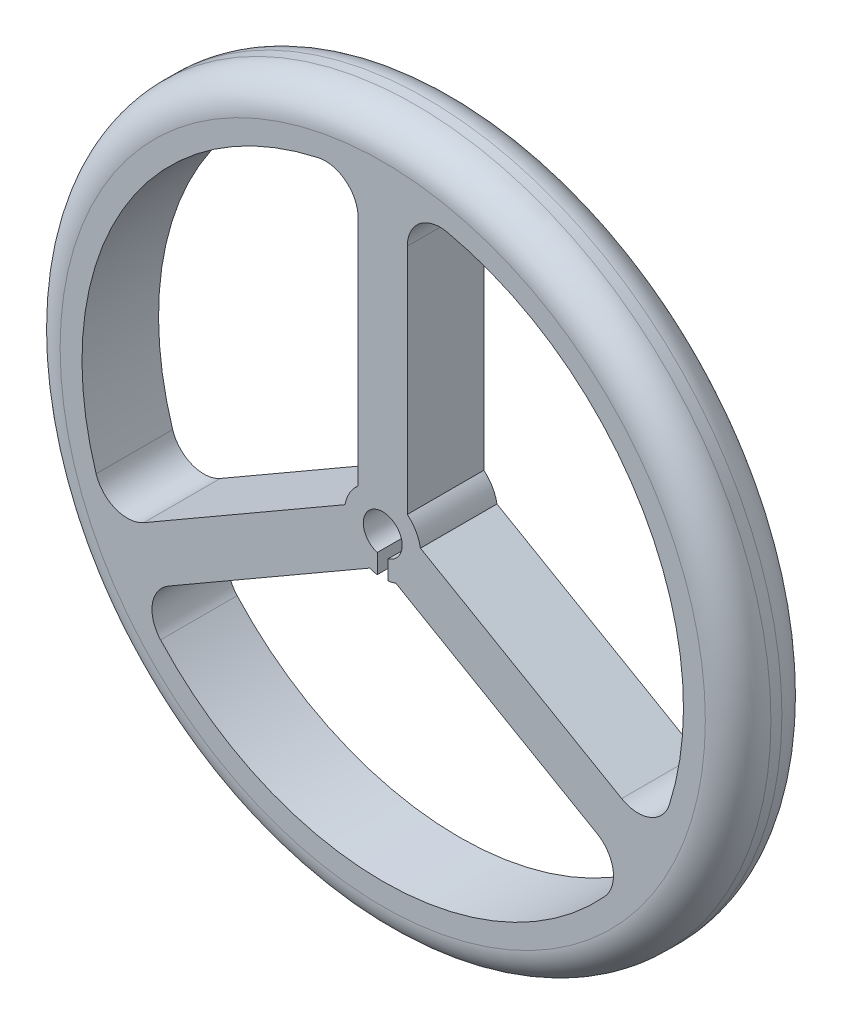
ISO-10303-21;
HEADER;
FILE_DESCRIPTION(('STEP AP214'),'2;1');
FILE_NAME('part.step','',(''),(''),'','','');
FILE_SCHEMA(('AUTOMOTIVE_DESIGN { 1 0 10303 214 1 1 1 1 }'));
ENDSEC;
DATA;
#1=APPLICATION_CONTEXT('core data for automotive mechanical design processes');
#2=APPLICATION_PROTOCOL_DEFINITION('international standard','automotive_design',2000,#1);
#3=PRODUCT_CONTEXT('',#1,'mechanical');
#4=PRODUCT('Part','Part','',(#3));
#5=PRODUCT_RELATED_PRODUCT_CATEGORY('part','',(#4));
#6=PRODUCT_DEFINITION_FORMATION('','',#4);
#7=PRODUCT_DEFINITION_CONTEXT('part definition',#1,'design');
#8=PRODUCT_DEFINITION('design','',#6,#7);
#9=PRODUCT_DEFINITION_SHAPE('','',#8);
#10=(LENGTH_UNIT() NAMED_UNIT(*) SI_UNIT(.MILLI.,.METRE.));
#11=(NAMED_UNIT(*) PLANE_ANGLE_UNIT() SI_UNIT($,.RADIAN.));
#12=(NAMED_UNIT(*) SI_UNIT($,.STERADIAN.) SOLID_ANGLE_UNIT());
#13=UNCERTAINTY_MEASURE_WITH_UNIT(LENGTH_MEASURE(1.E-05),#10,'distance_accuracy_value','');
#14=(GEOMETRIC_REPRESENTATION_CONTEXT(3) GLOBAL_UNCERTAINTY_ASSIGNED_CONTEXT((#13)) GLOBAL_UNIT_ASSIGNED_CONTEXT((#10,
#11,#12)) REPRESENTATION_CONTEXT('',''));
#15=CARTESIAN_POINT('',(0.,0.,0.));
#16=DIRECTION('',(0.,0.,1.));
#17=DIRECTION('',(1.,0.,0.));
#18=AXIS2_PLACEMENT_3D('',#15,#16,#17);
#19=CARTESIAN_POINT('',(0.,0.,7.));
#20=DIRECTION('',(0.,0.,-1.));
#21=DIRECTION('',(-1.,0.,0.));
#22=AXIS2_PLACEMENT_3D('',#19,#20,#21);
#23=CYLINDRICAL_SURFACE('',#22,3.5);
#24=CARTESIAN_POINT('',(0.,0.,0.));
#25=DIRECTION('',(0.,0.,-1.));
#26=DIRECTION('',(-1.,0.,0.));
#27=AXIS2_PLACEMENT_3D('',#24,#25,#26);
#28=CIRCLE('',#27,3.5);
#29=CARTESIAN_POINT('',(-0.5,-3.46410161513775,0.));
#30=VERTEX_POINT('',#29);
#31=CARTESIAN_POINT('',(-1.19677195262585,-3.28903282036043,0.));
#32=VERTEX_POINT('',#31);
#33=EDGE_CURVE('E274',#30,#32,#28,.T.);
#34=ORIENTED_EDGE('',*,*,#33,.F.);
#35=DIRECTION('',(0.,0.,-1.));
#36=VECTOR('',#35,1.);
#37=CARTESIAN_POINT('',(-0.5,-3.46410161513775,7.));
#38=LINE('',#37,#36);
#39=CARTESIAN_POINT('',(-0.5,-3.46410161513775,7.));
#40=VERTEX_POINT('',#39);
#41=EDGE_CURVE('E376',#30,#40,#38,.F.);
#42=ORIENTED_EDGE('',*,*,#41,.T.);
#43=CARTESIAN_POINT('',(0.,0.,7.));
#44=DIRECTION('',(0.,0.,-1.));
#45=DIRECTION('',(-1.,0.,0.));
#46=AXIS2_PLACEMENT_3D('',#43,#44,#45);
#47=CIRCLE('',#46,3.5);
#48=CARTESIAN_POINT('',(-1.19677195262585,-3.28903282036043,7.));
#49=VERTEX_POINT('',#48);
#50=EDGE_CURVE('E492',#40,#49,#47,.T.);
#51=ORIENTED_EDGE('',*,*,#50,.T.);
#52=DIRECTION('',(0.,0.,-1.));
#53=VECTOR('',#52,1.);
#54=CARTESIAN_POINT('',(-1.19677195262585,-3.28903282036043,7.));
#55=LINE('',#54,#53);
#56=EDGE_CURVE('E504',#49,#32,#55,.T.);
#57=ORIENTED_EDGE('',*,*,#56,.T.);
#58=EDGE_LOOP('',(#34,#42,#51,#57));
#59=FACE_BOUND('',#58,.T.);
#60=ADVANCED_FACE('F115',(#59),#23,.T.);
#61=CARTESIAN_POINT('',(0.,0.,7.));
#62=DIRECTION('',(0.,0.,-1.));
#63=DIRECTION('',(-1.,0.,0.));
#64=AXIS2_PLACEMENT_3D('',#61,#62,#63);
#65=CYLINDRICAL_SURFACE('',#64,27.5);
#66=CARTESIAN_POINT('',(0.,0.,7.));
#67=DIRECTION('',(0.,0.,1.));
#68=DIRECTION('',(1.,0.,0.));
#69=AXIS2_PLACEMENT_3D('',#66,#67,#68);
#70=CIRCLE('',#69,27.5);
#71=CARTESIAN_POINT('',(26.2089128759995,-8.32723758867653,7.));
#72=VERTEX_POINT('',#71);
#73=CARTESIAN_POINT('',(5.89285714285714,26.8612031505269,7.));
#74=VERTEX_POINT('',#73);
#75=EDGE_CURVE('E350',#72,#74,#70,.T.);
#76=ORIENTED_EDGE('',*,*,#75,.T.);
#77=DIRECTION('',(0.,0.,-1.));
#78=VECTOR('',#77,1.);
#79=CARTESIAN_POINT('',(5.89285714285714,26.8612031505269,7.));
#80=LINE('',#79,#78);
#81=CARTESIAN_POINT('',(5.89285714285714,26.8612031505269,0.));
#82=VERTEX_POINT('',#81);
#83=EDGE_CURVE('E390',#74,#82,#80,.T.);
#84=ORIENTED_EDGE('',*,*,#83,.T.);
#85=CARTESIAN_POINT('',(0.,0.,0.));
#86=DIRECTION('',(0.,0.,1.));
#87=DIRECTION('',(1.,0.,0.));
#88=AXIS2_PLACEMENT_3D('',#85,#86,#87);
#89=CIRCLE('',#88,27.5);
#90=CARTESIAN_POINT('',(26.2089128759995,-8.32723758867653,0.));
#91=VERTEX_POINT('',#90);
#92=EDGE_CURVE('E310',#91,#82,#89,.T.);
#93=ORIENTED_EDGE('',*,*,#92,.F.);
#94=DIRECTION('',(0.,0.,-1.));
#95=VECTOR('',#94,1.);
#96=CARTESIAN_POINT('',(26.2089128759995,-8.32723758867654,7.));
#97=LINE('',#96,#95);
#98=EDGE_CURVE('E387',#91,#72,#97,.F.);
#99=ORIENTED_EDGE('',*,*,#98,.T.);
#100=EDGE_LOOP('',(#76,#84,#93,#99));
#101=FACE_BOUND('',#100,.T.);
#102=ADVANCED_FACE('F550',(#101),#65,.F.);
#103=CARTESIAN_POINT('',(-5.89285714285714,26.8612031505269,0.));
#104=VERTEX_POINT('',#103);
#105=CARTESIAN_POINT('',(-26.2089128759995,-8.32723758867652,0.));
#106=VERTEX_POINT('',#105);
#107=EDGE_CURVE('E355',#104,#106,#89,.T.);
#108=ORIENTED_EDGE('',*,*,#107,.F.);
#109=DIRECTION('',(0.,0.,-1.));
#110=VECTOR('',#109,1.);
#111=CARTESIAN_POINT('',(-5.89285714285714,26.8612031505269,7.));
#112=LINE('',#111,#110);
#113=CARTESIAN_POINT('',(-5.89285714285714,26.8612031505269,7.));
#114=VERTEX_POINT('',#113);
#115=EDGE_CURVE('E397',#104,#114,#112,.F.);
#116=ORIENTED_EDGE('',*,*,#115,.T.);
#117=CARTESIAN_POINT('',(-26.2089128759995,-8.32723758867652,7.));
#118=VERTEX_POINT('',#117);
#119=EDGE_CURVE('E349',#114,#118,#70,.T.);
#120=ORIENTED_EDGE('',*,*,#119,.T.);
#121=DIRECTION('',(0.,0.,-1.));
#122=VECTOR('',#121,1.);
#123=CARTESIAN_POINT('',(-26.2089128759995,-8.32723758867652,7.));
#124=LINE('',#123,#122);
#125=EDGE_CURVE('E393',#118,#106,#124,.T.);
#126=ORIENTED_EDGE('',*,*,#125,.T.);
#127=EDGE_LOOP('',(#108,#116,#120,#126));
#128=FACE_BOUND('',#127,.T.);
#129=ADVANCED_FACE('F534',(#128),#65,.F.);
#130=CARTESIAN_POINT('',(-20.3160557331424,-18.5339655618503,7.));
#131=VERTEX_POINT('',#130);
#132=CARTESIAN_POINT('',(20.3160557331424,-18.5339655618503,7.));
#133=VERTEX_POINT('',#132);
#134=EDGE_CURVE('E345',#131,#133,#70,.T.);
#135=ORIENTED_EDGE('',*,*,#134,.T.);
#136=DIRECTION('',(0.,0.,-1.));
#137=VECTOR('',#136,1.);
#138=CARTESIAN_POINT('',(20.3160557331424,-18.5339655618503,7.));
#139=LINE('',#138,#137);
#140=CARTESIAN_POINT('',(20.3160557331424,-18.5339655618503,0.));
#141=VERTEX_POINT('',#140);
#142=EDGE_CURVE('E411',#133,#141,#139,.T.);
#143=ORIENTED_EDGE('',*,*,#142,.T.);
#144=CARTESIAN_POINT('',(-20.3160557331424,-18.5339655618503,0.));
#145=VERTEX_POINT('',#144);
#146=EDGE_CURVE('E351',#145,#141,#89,.T.);
#147=ORIENTED_EDGE('',*,*,#146,.F.);
#148=DIRECTION('',(0.,0.,-1.));
#149=VECTOR('',#148,1.);
#150=CARTESIAN_POINT('',(-20.3160557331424,-18.5339655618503,7.));
#151=LINE('',#150,#149);
#152=EDGE_CURVE('E408',#145,#131,#151,.F.);
#153=ORIENTED_EDGE('',*,*,#152,.T.);
#154=EDGE_LOOP('',(#135,#143,#147,#153));
#155=FACE_BOUND('',#154,.T.);
#156=ADVANCED_FACE('F558',(#155),#65,.F.);
#157=CARTESIAN_POINT('',(0.,0.,7.));
#158=DIRECTION('',(0.,0.,1.));
#159=DIRECTION('',(1.,0.,0.));
#160=AXIS2_PLACEMENT_3D('',#157,#158,#159);
#161=PLANE('',#160);
#162=DIRECTION('',(0.,-1.,0.));
#163=VECTOR('',#162,1.);
#164=CARTESIAN_POINT('',(0.5,-1.52241333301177,7.));
#165=LINE('',#164,#163);
#166=CARTESIAN_POINT('',(0.5,-1.70312213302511,7.));
#167=VERTEX_POINT('',#166);
#168=CARTESIAN_POINT('',(0.5,-3.46410161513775,7.));
#169=VERTEX_POINT('',#168);
#170=EDGE_CURVE('E268',#167,#169,#165,.T.);
#171=ORIENTED_EDGE('',*,*,#170,.T.);
#172=CARTESIAN_POINT('',(1.19677195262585,-3.28903282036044,7.));
#173=VERTEX_POINT('',#172);
#174=EDGE_CURVE('E486',#173,#169,#47,.T.);
#175=ORIENTED_EDGE('',*,*,#174,.F.);
#176=DIRECTION('',(0.86602540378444,-0.499999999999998,0.));
#177=VECTOR('',#176,1.);
#178=CARTESIAN_POINT('',(-1.125,-1.94855715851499,7.));
#179=LINE('',#178,#177);
#180=CARTESIAN_POINT('',(19.5997587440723,-13.9140021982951,7.));
#181=VERTEX_POINT('',#180);
#182=EDGE_CURVE('E314',#173,#181,#179,.T.);
#183=ORIENTED_EDGE('',*,*,#182,.T.);
#184=CARTESIAN_POINT('',(18.0997587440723,-16.5120784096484,7.));
#185=DIRECTION('',(0.,0.,1.));
#186=DIRECTION('',(1.,0.,0.));
#187=AXIS2_PLACEMENT_3D('',#184,#185,#186);
#188=CIRCLE('',#187,3.);
#189=EDGE_CURVE('E445',#181,#133,#188,.F.);
#190=ORIENTED_EDGE('',*,*,#189,.T.);
#191=ORIENTED_EDGE('',*,*,#134,.F.);
#192=CARTESIAN_POINT('',(-18.0997587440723,-16.5120784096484,7.));
#193=DIRECTION('',(0.,0.,1.));
#194=DIRECTION('',(1.,0.,0.));
#195=AXIS2_PLACEMENT_3D('',#192,#193,#194);
#196=CIRCLE('',#195,3.);
#197=CARTESIAN_POINT('',(-19.5997587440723,-13.9140021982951,7.));
#198=VERTEX_POINT('',#197);
#199=EDGE_CURVE('E451',#131,#198,#196,.F.);
#200=ORIENTED_EDGE('',*,*,#199,.T.);
#201=DIRECTION('',(-0.86602540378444,-0.499999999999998,0.));
#202=VECTOR('',#201,1.);
#203=CARTESIAN_POINT('',(1.12499999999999,-1.94855715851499,7.));
#204=LINE('',#203,#202);
#205=EDGE_CURVE('E333',#49,#198,#204,.T.);
#206=ORIENTED_EDGE('',*,*,#205,.F.);
#207=ORIENTED_EDGE('',*,*,#50,.F.);
#208=DIRECTION('',(0.,-1.,0.));
#209=VECTOR('',#208,1.);
#210=CARTESIAN_POINT('',(-0.5,-1.52241333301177,7.));
#211=LINE('',#210,#209);
#212=CARTESIAN_POINT('',(-0.5,-1.70312213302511,7.));
#213=VERTEX_POINT('',#212);
#214=EDGE_CURVE('E580',#213,#40,#211,.T.);
#215=ORIENTED_EDGE('',*,*,#214,.F.);
#216=CARTESIAN_POINT('',(0.,0.,7.));
#217=DIRECTION('',(0.,0.,-1.));
#218=DIRECTION('',(-1.,0.,0.));
#219=AXIS2_PLACEMENT_3D('',#216,#217,#218);
#220=CIRCLE('',#219,1.775);
#221=EDGE_CURVE('E292',#213,#167,#220,.T.);
#222=ORIENTED_EDGE('',*,*,#221,.T.);
#223=EDGE_LOOP('',(#171,#175,#183,#190,#191,#200,#206,#207,#215,#222));
#224=FACE_BOUND('',#223,.T.);
#225=ORIENTED_EDGE('',*,*,#119,.F.);
#226=CARTESIAN_POINT('',(-5.25,23.9308900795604,7.));
#227=DIRECTION('',(0.,0.,1.));
#228=DIRECTION('',(1.,0.,0.));
#229=AXIS2_PLACEMENT_3D('',#226,#227,#228);
#230=CIRCLE('',#229,3.);
#231=CARTESIAN_POINT('',(-2.25,23.9308900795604,7.));
#232=VERTEX_POINT('',#231);
#233=EDGE_CURVE('E430',#114,#232,#230,.F.);
#234=ORIENTED_EDGE('',*,*,#233,.T.);
#235=DIRECTION('',(0.,1.,0.));
#236=VECTOR('',#235,1.);
#237=CARTESIAN_POINT('',(-2.25,27.5,7.));
#238=LINE('',#237,#236);
#239=CARTESIAN_POINT('',(-2.25,2.6809513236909,7.));
#240=VERTEX_POINT('',#239);
#241=EDGE_CURVE('E306',#232,#240,#238,.F.);
#242=ORIENTED_EDGE('',*,*,#241,.T.);
#243=CARTESIAN_POINT('',(-3.44677195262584,0.608081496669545,7.));
#244=VERTEX_POINT('',#243);
#245=EDGE_CURVE('E485',#244,#240,#47,.T.);
#246=ORIENTED_EDGE('',*,*,#245,.F.);
#247=DIRECTION('',(-0.86602540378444,-0.499999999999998,0.));
#248=VECTOR('',#247,1.);
#249=CARTESIAN_POINT('',(-1.12499999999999,1.94855715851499,7.));
#250=LINE('',#249,#248);
#251=CARTESIAN_POINT('',(-21.8497587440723,-10.0168878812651,7.));
#252=VERTEX_POINT('',#251);
#253=EDGE_CURVE('E329',#244,#252,#250,.T.);
#254=ORIENTED_EDGE('',*,*,#253,.T.);
#255=CARTESIAN_POINT('',(-23.3497587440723,-7.41881166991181,7.));
#256=DIRECTION('',(0.,0.,1.));
#257=DIRECTION('',(1.,0.,0.));
#258=AXIS2_PLACEMENT_3D('',#255,#256,#257);
#259=CIRCLE('',#258,3.);
#260=EDGE_CURVE('E12',#252,#118,#259,.F.);
#261=ORIENTED_EDGE('',*,*,#260,.T.);
#262=EDGE_LOOP('',(#225,#234,#242,#246,#254,#261));
#263=FACE_BOUND('',#262,.T.);
#264=CARTESIAN_POINT('',(2.25,2.6809513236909,7.));
#265=VERTEX_POINT('',#264);
#266=CARTESIAN_POINT('',(3.44677195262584,0.608081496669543,7.));
#267=VERTEX_POINT('',#266);
#268=EDGE_CURVE('E481',#265,#267,#47,.T.);
#269=ORIENTED_EDGE('',*,*,#268,.F.);
#270=DIRECTION('',(0.,1.,0.));
#271=VECTOR('',#270,1.);
#272=CARTESIAN_POINT('',(2.25,27.5,7.));
#273=LINE('',#272,#271);
#274=CARTESIAN_POINT('',(2.25,23.9308900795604,7.));
#275=VERTEX_POINT('',#274);
#276=EDGE_CURVE('E303',#275,#265,#273,.F.);
#277=ORIENTED_EDGE('',*,*,#276,.F.);
#278=CARTESIAN_POINT('',(5.25,23.9308900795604,7.));
#279=DIRECTION('',(0.,0.,1.));
#280=DIRECTION('',(1.,0.,0.));
#281=AXIS2_PLACEMENT_3D('',#278,#279,#280);
#282=CIRCLE('',#281,3.);
#283=EDGE_CURVE('E424',#275,#74,#282,.F.);
#284=ORIENTED_EDGE('',*,*,#283,.T.);
#285=ORIENTED_EDGE('',*,*,#75,.F.);
#286=CARTESIAN_POINT('',(23.3497587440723,-7.41881166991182,7.));
#287=DIRECTION('',(0.,0.,1.));
#288=DIRECTION('',(1.,0.,0.));
#289=AXIS2_PLACEMENT_3D('',#286,#287,#288);
#290=CIRCLE('',#289,3.);
#291=CARTESIAN_POINT('',(21.8497587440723,-10.0168878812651,7.));
#292=VERTEX_POINT('',#291);
#293=EDGE_CURVE('E439',#72,#292,#290,.F.);
#294=ORIENTED_EDGE('',*,*,#293,.T.);
#295=DIRECTION('',(0.86602540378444,-0.499999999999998,0.));
#296=VECTOR('',#295,1.);
#297=CARTESIAN_POINT('',(1.125,1.94855715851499,7.));
#298=LINE('',#297,#296);
#299=EDGE_CURVE('E317',#267,#292,#298,.T.);
#300=ORIENTED_EDGE('',*,*,#299,.F.);
#301=EDGE_LOOP('',(#269,#277,#284,#285,#294,#300));
#302=FACE_BOUND('',#301,.T.);
#303=CARTESIAN_POINT('',(0.,0.,7.));
#304=DIRECTION('',(0.,0.,1.));
#305=DIRECTION('',(1.,0.,0.));
#306=AXIS2_PLACEMENT_3D('',#303,#304,#305);
#307=CIRCLE('',#306,29.5);
#308=CARTESIAN_POINT('',(29.5,0.,7.));
#309=VERTEX_POINT('',#308);
#310=EDGE_CURVE('E356',#309,#309,#307,.T.);
#311=ORIENTED_EDGE('',*,*,#310,.T.);
#312=EDGE_LOOP('',(#311));
#313=FACE_BOUND('',#312,.T.);
#314=ADVANCED_FACE('F477',(#224,#263,#302,#313),#161,.T.);
#315=CARTESIAN_POINT('',(0.,0.,0.));
#316=DIRECTION('',(0.,0.,1.));
#317=DIRECTION('',(1.,0.,0.));
#318=AXIS2_PLACEMENT_3D('',#315,#316,#317);
#319=PLANE('',#318);
#320=CARTESIAN_POINT('',(-3.44677195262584,0.608081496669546,0.));
#321=VERTEX_POINT('',#320);
#322=CARTESIAN_POINT('',(-2.25,2.6809513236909,0.));
#323=VERTEX_POINT('',#322);
#324=EDGE_CURVE('E496',#321,#323,#28,.T.);
#325=ORIENTED_EDGE('',*,*,#324,.T.);
#326=DIRECTION('',(0.,1.,0.));
#327=VECTOR('',#326,1.);
#328=CARTESIAN_POINT('',(-2.25,27.5,0.));
#329=LINE('',#328,#327);
#330=CARTESIAN_POINT('',(-2.25,23.9308900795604,0.));
#331=VERTEX_POINT('',#330);
#332=EDGE_CURVE('E307',#331,#323,#329,.F.);
#333=ORIENTED_EDGE('',*,*,#332,.F.);
#334=CARTESIAN_POINT('',(-5.25,23.9308900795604,0.));
#335=DIRECTION('',(0.,0.,1.));
#336=DIRECTION('',(1.,0.,0.));
#337=AXIS2_PLACEMENT_3D('',#334,#335,#336);
#338=CIRCLE('',#337,3.);
#339=EDGE_CURVE('E433',#331,#104,#338,.T.);
#340=ORIENTED_EDGE('',*,*,#339,.T.);
#341=ORIENTED_EDGE('',*,*,#107,.T.);
#342=CARTESIAN_POINT('',(-23.3497587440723,-7.41881166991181,0.));
#343=DIRECTION('',(0.,0.,1.));
#344=DIRECTION('',(1.,0.,0.));
#345=AXIS2_PLACEMENT_3D('',#342,#343,#344);
#346=CIRCLE('',#345,3.);
#347=CARTESIAN_POINT('',(-21.8497587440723,-10.0168878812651,0.));
#348=VERTEX_POINT('',#347);
#349=EDGE_CURVE('E124',#106,#348,#346,.T.);
#350=ORIENTED_EDGE('',*,*,#349,.T.);
#351=DIRECTION('',(-0.86602540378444,-0.499999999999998,0.));
#352=VECTOR('',#351,1.);
#353=CARTESIAN_POINT('',(-1.12499999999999,1.94855715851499,0.));
#354=LINE('',#353,#352);
#355=EDGE_CURVE('E337',#321,#348,#354,.T.);
#356=ORIENTED_EDGE('',*,*,#355,.F.);
#357=EDGE_LOOP('',(#325,#333,#340,#341,#350,#356));
#358=FACE_BOUND('',#357,.T.);
#359=CARTESIAN_POINT('',(1.19677195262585,-3.28903282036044,0.));
#360=VERTEX_POINT('',#359);
#361=CARTESIAN_POINT('',(0.5,-3.46410161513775,0.));
#362=VERTEX_POINT('',#361);
#363=EDGE_CURVE('E285',#360,#362,#28,.T.);
#364=ORIENTED_EDGE('',*,*,#363,.T.);
#365=DIRECTION('',(0.,-1.,0.));
#366=VECTOR('',#365,1.);
#367=CARTESIAN_POINT('',(0.5,-1.52241333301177,0.));
#368=LINE('',#367,#366);
#369=CARTESIAN_POINT('',(0.5,-1.70312213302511,0.));
#370=VERTEX_POINT('',#369);
#371=EDGE_CURVE('E265',#370,#362,#368,.T.);
#372=ORIENTED_EDGE('',*,*,#371,.F.);
#373=CARTESIAN_POINT('',(0.,0.,0.));
#374=DIRECTION('',(0.,0.,-1.));
#375=DIRECTION('',(-1.,0.,0.));
#376=AXIS2_PLACEMENT_3D('',#373,#374,#375);
#377=CIRCLE('',#376,1.775);
#378=CARTESIAN_POINT('',(-0.5,-1.70312213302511,0.));
#379=VERTEX_POINT('',#378);
#380=EDGE_CURVE('E283',#379,#370,#377,.T.);
#381=ORIENTED_EDGE('',*,*,#380,.F.);
#382=DIRECTION('',(0.,-1.,0.));
#383=VECTOR('',#382,1.);
#384=CARTESIAN_POINT('',(-0.5,-1.52241333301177,0.));
#385=LINE('',#384,#383);
#386=EDGE_CURVE('E287',#379,#30,#385,.T.);
#387=ORIENTED_EDGE('',*,*,#386,.T.);
#388=ORIENTED_EDGE('',*,*,#33,.T.);
#389=DIRECTION('',(-0.86602540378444,-0.499999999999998,0.));
#390=VECTOR('',#389,1.);
#391=CARTESIAN_POINT('',(1.12499999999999,-1.94855715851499,0.));
#392=LINE('',#391,#390);
#393=CARTESIAN_POINT('',(-19.5997587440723,-13.9140021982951,0.));
#394=VERTEX_POINT('',#393);
#395=EDGE_CURVE('E297',#32,#394,#392,.T.);
#396=ORIENTED_EDGE('',*,*,#395,.T.);
#397=CARTESIAN_POINT('',(-18.0997587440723,-16.5120784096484,0.));
#398=DIRECTION('',(0.,0.,1.));
#399=DIRECTION('',(1.,0.,0.));
#400=AXIS2_PLACEMENT_3D('',#397,#398,#399);
#401=CIRCLE('',#400,3.);
#402=EDGE_CURVE('E448',#394,#145,#401,.T.);
#403=ORIENTED_EDGE('',*,*,#402,.T.);
#404=ORIENTED_EDGE('',*,*,#146,.T.);
#405=CARTESIAN_POINT('',(18.0997587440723,-16.5120784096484,0.));
#406=DIRECTION('',(0.,0.,1.));
#407=DIRECTION('',(1.,0.,0.));
#408=AXIS2_PLACEMENT_3D('',#405,#406,#407);
#409=CIRCLE('',#408,3.);
#410=CARTESIAN_POINT('',(19.5997587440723,-13.9140021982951,0.));
#411=VERTEX_POINT('',#410);
#412=EDGE_CURVE('E442',#141,#411,#409,.T.);
#413=ORIENTED_EDGE('',*,*,#412,.T.);
#414=DIRECTION('',(0.86602540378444,-0.499999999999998,0.));
#415=VECTOR('',#414,1.);
#416=CARTESIAN_POINT('',(-1.125,-1.94855715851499,0.));
#417=LINE('',#416,#415);
#418=EDGE_CURVE('E321',#360,#411,#417,.T.);
#419=ORIENTED_EDGE('',*,*,#418,.F.);
#420=EDGE_LOOP('',(#364,#372,#381,#387,#388,#396,#403,#404,#413,#419));
#421=FACE_BOUND('',#420,.T.);
#422=ORIENTED_EDGE('',*,*,#92,.T.);
#423=CARTESIAN_POINT('',(5.25,23.9308900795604,0.));
#424=DIRECTION('',(0.,0.,1.));
#425=DIRECTION('',(1.,0.,0.));
#426=AXIS2_PLACEMENT_3D('',#423,#424,#425);
#427=CIRCLE('',#426,3.);
#428=CARTESIAN_POINT('',(2.25,23.9308900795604,0.));
#429=VERTEX_POINT('',#428);
#430=EDGE_CURVE('E427',#82,#429,#427,.T.);
#431=ORIENTED_EDGE('',*,*,#430,.T.);
#432=DIRECTION('',(0.,1.,0.));
#433=VECTOR('',#432,1.);
#434=CARTESIAN_POINT('',(2.25,27.5,0.));
#435=LINE('',#434,#433);
#436=CARTESIAN_POINT('',(2.25,2.6809513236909,0.));
#437=VERTEX_POINT('',#436);
#438=EDGE_CURVE('E311',#429,#437,#435,.F.);
#439=ORIENTED_EDGE('',*,*,#438,.T.);
#440=CARTESIAN_POINT('',(3.44677195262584,0.608081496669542,0.));
#441=VERTEX_POINT('',#440);
#442=EDGE_CURVE('E500',#437,#441,#28,.T.);
#443=ORIENTED_EDGE('',*,*,#442,.T.);
#444=DIRECTION('',(0.86602540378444,-0.499999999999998,0.));
#445=VECTOR('',#444,1.);
#446=CARTESIAN_POINT('',(1.125,1.94855715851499,0.));
#447=LINE('',#446,#445);
#448=CARTESIAN_POINT('',(21.8497587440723,-10.0168878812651,0.));
#449=VERTEX_POINT('',#448);
#450=EDGE_CURVE('E325',#441,#449,#447,.T.);
#451=ORIENTED_EDGE('',*,*,#450,.T.);
#452=CARTESIAN_POINT('',(23.3497587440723,-7.41881166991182,0.));
#453=DIRECTION('',(0.,0.,1.));
#454=DIRECTION('',(1.,0.,0.));
#455=AXIS2_PLACEMENT_3D('',#452,#453,#454);
#456=CIRCLE('',#455,3.);
#457=EDGE_CURVE('E436',#449,#91,#456,.T.);
#458=ORIENTED_EDGE('',*,*,#457,.T.);
#459=EDGE_LOOP('',(#422,#431,#439,#443,#451,#458));
#460=FACE_BOUND('',#459,.T.);
#461=CARTESIAN_POINT('',(0.,0.,0.));
#462=DIRECTION('',(0.,0.,1.));
#463=DIRECTION('',(1.,0.,0.));
#464=AXIS2_PLACEMENT_3D('',#461,#462,#463);
#465=CIRCLE('',#464,29.5);
#466=CARTESIAN_POINT('',(29.5,0.,0.));
#467=VERTEX_POINT('',#466);
#468=EDGE_CURVE('E368',#467,#467,#465,.F.);
#469=ORIENTED_EDGE('',*,*,#468,.T.);
#470=EDGE_LOOP('',(#469));
#471=FACE_BOUND('',#470,.T.);
#472=ADVANCED_FACE('F280',(#358,#421,#460,#471),#319,.F.);
#473=CARTESIAN_POINT('',(0.,0.,7.));
#474=DIRECTION('',(0.,0.,-1.));
#475=DIRECTION('',(-1.,0.,0.));
#476=AXIS2_PLACEMENT_3D('',#473,#474,#475);
#477=CYLINDRICAL_SURFACE('',#476,32.5);
#478=CARTESIAN_POINT('',(0.,0.,4.));
#479=DIRECTION('',(0.,0.,1.));
#480=DIRECTION('',(1.,0.,0.));
#481=AXIS2_PLACEMENT_3D('',#478,#479,#480);
#482=CIRCLE('',#481,32.5);
#483=CARTESIAN_POINT('',(32.5,0.,4.));
#484=VERTEX_POINT('',#483);
#485=EDGE_CURVE('E364',#484,#484,#482,.F.);
#486=ORIENTED_EDGE('',*,*,#485,.T.);
#487=EDGE_LOOP('',(#486));
#488=FACE_BOUND('',#487,.T.);
#489=CARTESIAN_POINT('',(0.,0.,3.));
#490=DIRECTION('',(0.,0.,1.));
#491=DIRECTION('',(1.,0.,0.));
#492=AXIS2_PLACEMENT_3D('',#489,#490,#491);
#493=CIRCLE('',#492,32.5);
#494=CARTESIAN_POINT('',(32.5,0.,3.));
#495=VERTEX_POINT('',#494);
#496=EDGE_CURVE('E360',#495,#495,#493,.T.);
#497=ORIENTED_EDGE('',*,*,#496,.T.);
#498=EDGE_LOOP('',(#497));
#499=FACE_BOUND('',#498,.T.);
#500=ADVANCED_FACE('F762',(#488,#499),#477,.T.);
#501=CARTESIAN_POINT('',(0.,0.,4.));
#502=DIRECTION('',(0.,0.,1.));
#503=DIRECTION('',(1.,0.,0.));
#504=AXIS2_PLACEMENT_3D('',#501,#502,#503);
#505=TOROIDAL_SURFACE('',#504,29.5,3.);
#506=ORIENTED_EDGE('',*,*,#485,.F.);
#507=EDGE_LOOP('',(#506));
#508=FACE_BOUND('',#507,.T.);
#509=ORIENTED_EDGE('',*,*,#310,.F.);
#510=EDGE_LOOP('',(#509));
#511=FACE_BOUND('',#510,.T.);
#512=ADVANCED_FACE('F828',(#508,#511),#505,.T.);
#513=CARTESIAN_POINT('',(0.,0.,3.));
#514=DIRECTION('',(0.,0.,1.));
#515=DIRECTION('',(1.,0.,0.));
#516=AXIS2_PLACEMENT_3D('',#513,#514,#515);
#517=TOROIDAL_SURFACE('',#516,29.5,3.);
#518=ORIENTED_EDGE('',*,*,#468,.F.);
#519=EDGE_LOOP('',(#518));
#520=FACE_BOUND('',#519,.T.);
#521=ORIENTED_EDGE('',*,*,#496,.F.);
#522=EDGE_LOOP('',(#521));
#523=FACE_BOUND('',#522,.T.);
#524=ADVANCED_FACE('F618',(#520,#523),#517,.T.);
#525=CARTESIAN_POINT('',(2.25,27.5,7.));
#526=DIRECTION('',(1.,0.,0.));
#527=DIRECTION('',(0.,0.,-1.));
#528=AXIS2_PLACEMENT_3D('',#525,#526,#527);
#529=PLANE('',#528);
#530=ORIENTED_EDGE('',*,*,#438,.F.);
#531=DIRECTION('',(0.,0.,1.));
#532=VECTOR('',#531,1.);
#533=CARTESIAN_POINT('',(2.25,23.9308900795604,7.));
#534=LINE('',#533,#532);
#535=EDGE_CURVE('E383',#429,#275,#534,.T.);
#536=ORIENTED_EDGE('',*,*,#535,.T.);
#537=ORIENTED_EDGE('',*,*,#276,.T.);
#538=DIRECTION('',(0.,0.,-1.));
#539=VECTOR('',#538,1.);
#540=CARTESIAN_POINT('',(2.25,2.6809513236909,7.));
#541=LINE('',#540,#539);
#542=EDGE_CURVE('E293',#437,#265,#541,.F.);
#543=ORIENTED_EDGE('',*,*,#542,.F.);
#544=EDGE_LOOP('',(#530,#536,#537,#543));
#545=FACE_BOUND('',#544,.T.);
#546=ADVANCED_FACE('F473',(#545),#529,.T.);
#547=CARTESIAN_POINT('',(-2.25,27.5,7.));
#548=DIRECTION('',(1.,0.,0.));
#549=DIRECTION('',(0.,0.,-1.));
#550=AXIS2_PLACEMENT_3D('',#547,#548,#549);
#551=PLANE('',#550);
#552=ORIENTED_EDGE('',*,*,#241,.F.);
#553=DIRECTION('',(0.,0.,-1.));
#554=VECTOR('',#553,1.);
#555=CARTESIAN_POINT('',(-2.25,23.9308900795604,7.));
#556=LINE('',#555,#554);
#557=EDGE_CURVE('E401',#232,#331,#556,.T.);
#558=ORIENTED_EDGE('',*,*,#557,.T.);
#559=ORIENTED_EDGE('',*,*,#332,.T.);
#560=DIRECTION('',(0.,0.,-1.));
#561=VECTOR('',#560,1.);
#562=CARTESIAN_POINT('',(-2.25,2.6809513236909,7.));
#563=LINE('',#562,#561);
#564=EDGE_CURVE('E300',#323,#240,#563,.F.);
#565=ORIENTED_EDGE('',*,*,#564,.T.);
#566=EDGE_LOOP('',(#552,#558,#559,#565));
#567=FACE_BOUND('',#566,.T.);
#568=ADVANCED_FACE('F517',(#567),#551,.F.);
#569=CARTESIAN_POINT('',(-1.12499999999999,1.94855715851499,7.));
#570=DIRECTION('',(0.499999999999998,-0.86602540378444,0.));
#571=DIRECTION('',(0.86602540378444,0.499999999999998,0.));
#572=AXIS2_PLACEMENT_3D('',#569,#570,#571);
#573=PLANE('',#572);
#574=ORIENTED_EDGE('',*,*,#355,.T.);
#575=DIRECTION('',(0.,0.,-1.));
#576=VECTOR('',#575,1.);
#577=CARTESIAN_POINT('',(-21.8497587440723,-10.0168878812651,7.));
#578=LINE('',#577,#576);
#579=EDGE_CURVE('E137',#348,#252,#578,.F.);
#580=ORIENTED_EDGE('',*,*,#579,.T.);
#581=ORIENTED_EDGE('',*,*,#253,.F.);
#582=DIRECTION('',(0.,0.,-1.));
#583=VECTOR('',#582,1.);
#584=CARTESIAN_POINT('',(-3.44677195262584,0.608081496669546,7.));
#585=LINE('',#584,#583);
#586=EDGE_CURVE('E508',#244,#321,#585,.T.);
#587=ORIENTED_EDGE('',*,*,#586,.T.);
#588=EDGE_LOOP('',(#574,#580,#581,#587));
#589=FACE_BOUND('',#588,.T.);
#590=ADVANCED_FACE('F536',(#589),#573,.F.);
#591=CARTESIAN_POINT('',(1.12499999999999,-1.94855715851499,7.));
#592=DIRECTION('',(0.499999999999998,-0.86602540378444,0.));
#593=DIRECTION('',(0.86602540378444,0.499999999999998,0.));
#594=AXIS2_PLACEMENT_3D('',#591,#592,#593);
#595=PLANE('',#594);
#596=ORIENTED_EDGE('',*,*,#205,.T.);
#597=DIRECTION('',(0.,0.,1.));
#598=VECTOR('',#597,1.);
#599=CARTESIAN_POINT('',(-19.5997587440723,-13.9140021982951,0.));
#600=LINE('',#599,#598);
#601=EDGE_CURVE('E418',#198,#394,#600,.F.);
#602=ORIENTED_EDGE('',*,*,#601,.T.);
#603=ORIENTED_EDGE('',*,*,#395,.F.);
#604=ORIENTED_EDGE('',*,*,#56,.F.);
#605=EDGE_LOOP('',(#596,#602,#603,#604));
#606=FACE_BOUND('',#605,.T.);
#607=ADVANCED_FACE('F538',(#606),#595,.T.);
#608=CARTESIAN_POINT('',(-1.125,-1.94855715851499,7.));
#609=DIRECTION('',(0.499999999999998,0.86602540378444,0.));
#610=DIRECTION('',(-0.86602540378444,0.499999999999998,0.));
#611=AXIS2_PLACEMENT_3D('',#608,#609,#610);
#612=PLANE('',#611);
#613=ORIENTED_EDGE('',*,*,#418,.T.);
#614=DIRECTION('',(0.,0.,-1.));
#615=VECTOR('',#614,1.);
#616=CARTESIAN_POINT('',(19.5997587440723,-13.9140021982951,7.));
#617=LINE('',#616,#615);
#618=EDGE_CURVE('E415',#411,#181,#617,.F.);
#619=ORIENTED_EDGE('',*,*,#618,.T.);
#620=ORIENTED_EDGE('',*,*,#182,.F.);
#621=DIRECTION('',(0.,0.,-1.));
#622=VECTOR('',#621,1.);
#623=CARTESIAN_POINT('',(1.19677195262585,-3.28903282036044,7.));
#624=LINE('',#623,#622);
#625=EDGE_CURVE('E491',#173,#360,#624,.T.);
#626=ORIENTED_EDGE('',*,*,#625,.T.);
#627=EDGE_LOOP('',(#613,#619,#620,#626));
#628=FACE_BOUND('',#627,.T.);
#629=ADVANCED_FACE('F544',(#628),#612,.F.);
#630=CARTESIAN_POINT('',(1.125,1.94855715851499,7.));
#631=DIRECTION('',(0.499999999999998,0.86602540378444,0.));
#632=DIRECTION('',(-0.86602540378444,0.499999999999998,0.));
#633=AXIS2_PLACEMENT_3D('',#630,#631,#632);
#634=PLANE('',#633);
#635=ORIENTED_EDGE('',*,*,#299,.T.);
#636=DIRECTION('',(0.,0.,1.));
#637=VECTOR('',#636,1.);
#638=CARTESIAN_POINT('',(21.8497587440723,-10.0168878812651,0.));
#639=LINE('',#638,#637);
#640=EDGE_CURVE('E404',#292,#449,#639,.F.);
#641=ORIENTED_EDGE('',*,*,#640,.T.);
#642=ORIENTED_EDGE('',*,*,#450,.F.);
#643=DIRECTION('',(0.,0.,-1.));
#644=VECTOR('',#643,1.);
#645=CARTESIAN_POINT('',(3.44677195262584,0.608081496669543,7.));
#646=LINE('',#645,#644);
#647=EDGE_CURVE('E372',#267,#441,#646,.T.);
#648=ORIENTED_EDGE('',*,*,#647,.F.);
#649=EDGE_LOOP('',(#635,#641,#642,#648));
#650=FACE_BOUND('',#649,.T.);
#651=ADVANCED_FACE('F610',(#650),#634,.T.);
#652=CARTESIAN_POINT('',(0.,0.,7.));
#653=DIRECTION('',(0.,0.,-1.));
#654=DIRECTION('',(-1.,0.,0.));
#655=AXIS2_PLACEMENT_3D('',#652,#653,#654);
#656=CYLINDRICAL_SURFACE('',#655,1.775);
#657=ORIENTED_EDGE('',*,*,#380,.T.);
#658=DIRECTION('',(0.,0.,-1.));
#659=VECTOR('',#658,1.);
#660=CARTESIAN_POINT('',(0.5,-1.70312213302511,7.));
#661=LINE('',#660,#659);
#662=EDGE_CURVE('E262',#370,#167,#661,.F.);
#663=ORIENTED_EDGE('',*,*,#662,.T.);
#664=ORIENTED_EDGE('',*,*,#221,.F.);
#665=DIRECTION('',(0.,0.,-1.));
#666=VECTOR('',#665,1.);
#667=CARTESIAN_POINT('',(-0.5,-1.70312213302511,7.));
#668=LINE('',#667,#666);
#669=EDGE_CURVE('E275',#379,#213,#668,.F.);
#670=ORIENTED_EDGE('',*,*,#669,.F.);
#671=EDGE_LOOP('',(#657,#663,#664,#670));
#672=FACE_BOUND('',#671,.T.);
#673=ADVANCED_FACE('F290',(#672),#656,.F.);
#674=ORIENTED_EDGE('',*,*,#442,.F.);
#675=ORIENTED_EDGE('',*,*,#542,.T.);
#676=ORIENTED_EDGE('',*,*,#268,.T.);
#677=ORIENTED_EDGE('',*,*,#647,.T.);
#678=EDGE_LOOP('',(#674,#675,#676,#677));
#679=FACE_BOUND('',#678,.T.);
#680=ADVANCED_FACE('F553',(#679),#23,.T.);
#681=DIRECTION('',(0.,0.,-1.));
#682=VECTOR('',#681,1.);
#683=CARTESIAN_POINT('',(0.5,-3.46410161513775,7.));
#684=LINE('',#683,#682);
#685=EDGE_CURVE('E380',#362,#169,#684,.F.);
#686=ORIENTED_EDGE('',*,*,#685,.F.);
#687=ORIENTED_EDGE('',*,*,#363,.F.);
#688=ORIENTED_EDGE('',*,*,#625,.F.);
#689=ORIENTED_EDGE('',*,*,#174,.T.);
#690=EDGE_LOOP('',(#686,#687,#688,#689));
#691=FACE_BOUND('',#690,.T.);
#692=ADVANCED_FACE('F563',(#691),#23,.T.);
#693=ORIENTED_EDGE('',*,*,#564,.F.);
#694=ORIENTED_EDGE('',*,*,#324,.F.);
#695=ORIENTED_EDGE('',*,*,#586,.F.);
#696=ORIENTED_EDGE('',*,*,#245,.T.);
#697=EDGE_LOOP('',(#693,#694,#695,#696));
#698=FACE_BOUND('',#697,.T.);
#699=ADVANCED_FACE('F524',(#698),#23,.T.);
#700=CARTESIAN_POINT('',(-0.5,-1.52241333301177,7.));
#701=DIRECTION('',(1.,0.,0.));
#702=DIRECTION('',(0.,0.,-1.));
#703=AXIS2_PLACEMENT_3D('',#700,#701,#702);
#704=PLANE('',#703);
#705=ORIENTED_EDGE('',*,*,#669,.T.);
#706=ORIENTED_EDGE('',*,*,#214,.T.);
#707=ORIENTED_EDGE('',*,*,#41,.F.);
#708=ORIENTED_EDGE('',*,*,#386,.F.);
#709=EDGE_LOOP('',(#705,#706,#707,#708));
#710=FACE_BOUND('',#709,.T.);
#711=ADVANCED_FACE('F565',(#710),#704,.T.);
#712=CARTESIAN_POINT('',(0.5,-1.52241333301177,7.));
#713=DIRECTION('',(1.,0.,0.));
#714=DIRECTION('',(0.,0.,-1.));
#715=AXIS2_PLACEMENT_3D('',#712,#713,#714);
#716=PLANE('',#715);
#717=ORIENTED_EDGE('',*,*,#371,.T.);
#718=ORIENTED_EDGE('',*,*,#685,.T.);
#719=ORIENTED_EDGE('',*,*,#170,.F.);
#720=ORIENTED_EDGE('',*,*,#662,.F.);
#721=EDGE_LOOP('',(#717,#718,#719,#720));
#722=FACE_BOUND('',#721,.T.);
#723=ADVANCED_FACE('F264',(#722),#716,.F.);
#724=CARTESIAN_POINT('',(5.25,23.9308900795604,7.));
#725=DIRECTION('',(0.,0.,-1.));
#726=DIRECTION('',(-1.,0.,0.));
#727=AXIS2_PLACEMENT_3D('',#724,#725,#726);
#728=CYLINDRICAL_SURFACE('',#727,3.);
#729=ORIENTED_EDGE('',*,*,#430,.F.);
#730=ORIENTED_EDGE('',*,*,#83,.F.);
#731=ORIENTED_EDGE('',*,*,#283,.F.);
#732=ORIENTED_EDGE('',*,*,#535,.F.);
#733=EDGE_LOOP('',(#729,#730,#731,#732));
#734=FACE_BOUND('',#733,.T.);
#735=ADVANCED_FACE('F470',(#734),#728,.F.);
#736=CARTESIAN_POINT('',(-5.25,23.9308900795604,7.));
#737=DIRECTION('',(0.,0.,-1.));
#738=DIRECTION('',(-1.,0.,0.));
#739=AXIS2_PLACEMENT_3D('',#736,#737,#738);
#740=CYLINDRICAL_SURFACE('',#739,3.);
#741=ORIENTED_EDGE('',*,*,#339,.F.);
#742=ORIENTED_EDGE('',*,*,#557,.F.);
#743=ORIENTED_EDGE('',*,*,#233,.F.);
#744=ORIENTED_EDGE('',*,*,#115,.F.);
#745=EDGE_LOOP('',(#741,#742,#743,#744));
#746=FACE_BOUND('',#745,.T.);
#747=ADVANCED_FACE('F531',(#746),#740,.F.);
#748=CARTESIAN_POINT('',(23.3497587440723,-7.41881166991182,7.));
#749=DIRECTION('',(0.,0.,-1.));
#750=DIRECTION('',(-1.,0.,0.));
#751=AXIS2_PLACEMENT_3D('',#748,#749,#750);
#752=CYLINDRICAL_SURFACE('',#751,3.);
#753=ORIENTED_EDGE('',*,*,#293,.F.);
#754=ORIENTED_EDGE('',*,*,#98,.F.);
#755=ORIENTED_EDGE('',*,*,#457,.F.);
#756=ORIENTED_EDGE('',*,*,#640,.F.);
#757=EDGE_LOOP('',(#753,#754,#755,#756));
#758=FACE_BOUND('',#757,.T.);
#759=ADVANCED_FACE('F679',(#758),#752,.F.);
#760=CARTESIAN_POINT('',(18.0997587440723,-16.5120784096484,7.));
#761=DIRECTION('',(0.,0.,-1.));
#762=DIRECTION('',(-1.,0.,0.));
#763=AXIS2_PLACEMENT_3D('',#760,#761,#762);
#764=CYLINDRICAL_SURFACE('',#763,3.);
#765=ORIENTED_EDGE('',*,*,#189,.F.);
#766=ORIENTED_EDGE('',*,*,#618,.F.);
#767=ORIENTED_EDGE('',*,*,#412,.F.);
#768=ORIENTED_EDGE('',*,*,#142,.F.);
#769=EDGE_LOOP('',(#765,#766,#767,#768));
#770=FACE_BOUND('',#769,.T.);
#771=ADVANCED_FACE('F606',(#770),#764,.F.);
#772=CARTESIAN_POINT('',(-18.0997587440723,-16.5120784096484,7.));
#773=DIRECTION('',(0.,0.,-1.));
#774=DIRECTION('',(-1.,0.,0.));
#775=AXIS2_PLACEMENT_3D('',#772,#773,#774);
#776=CYLINDRICAL_SURFACE('',#775,3.);
#777=ORIENTED_EDGE('',*,*,#199,.F.);
#778=ORIENTED_EDGE('',*,*,#152,.F.);
#779=ORIENTED_EDGE('',*,*,#402,.F.);
#780=ORIENTED_EDGE('',*,*,#601,.F.);
#781=EDGE_LOOP('',(#777,#778,#779,#780));
#782=FACE_BOUND('',#781,.T.);
#783=ADVANCED_FACE('F598',(#782),#776,.F.);
#784=CARTESIAN_POINT('',(-23.3497587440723,-7.41881166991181,7.));
#785=DIRECTION('',(0.,0.,-1.));
#786=DIRECTION('',(-1.,0.,0.));
#787=AXIS2_PLACEMENT_3D('',#784,#785,#786);
#788=CYLINDRICAL_SURFACE('',#787,3.);
#789=ORIENTED_EDGE('',*,*,#260,.F.);
#790=ORIENTED_EDGE('',*,*,#579,.F.);
#791=ORIENTED_EDGE('',*,*,#349,.F.);
#792=ORIENTED_EDGE('',*,*,#125,.F.);
#793=EDGE_LOOP('',(#789,#790,#791,#792));
#794=FACE_BOUND('',#793,.T.);
#795=ADVANCED_FACE('F117',(#794),#788,.F.);
#796=CLOSED_SHELL('',(#60,#102,#129,#156,#314,#472,#500,#512,#524,#546,#568,#590,#607,#629,#651,
#673,#680,#692,#699,#711,#723,#735,#747,#759,#771,#783,#795));
#797=MANIFOLD_SOLID_BREP('B2',#796);
#798=ADVANCED_BREP_SHAPE_REPRESENTATION('',(#18,#797),#14);
#799=SHAPE_DEFINITION_REPRESENTATION(#9,#798);
ENDSEC;
END-ISO-10303-21;
